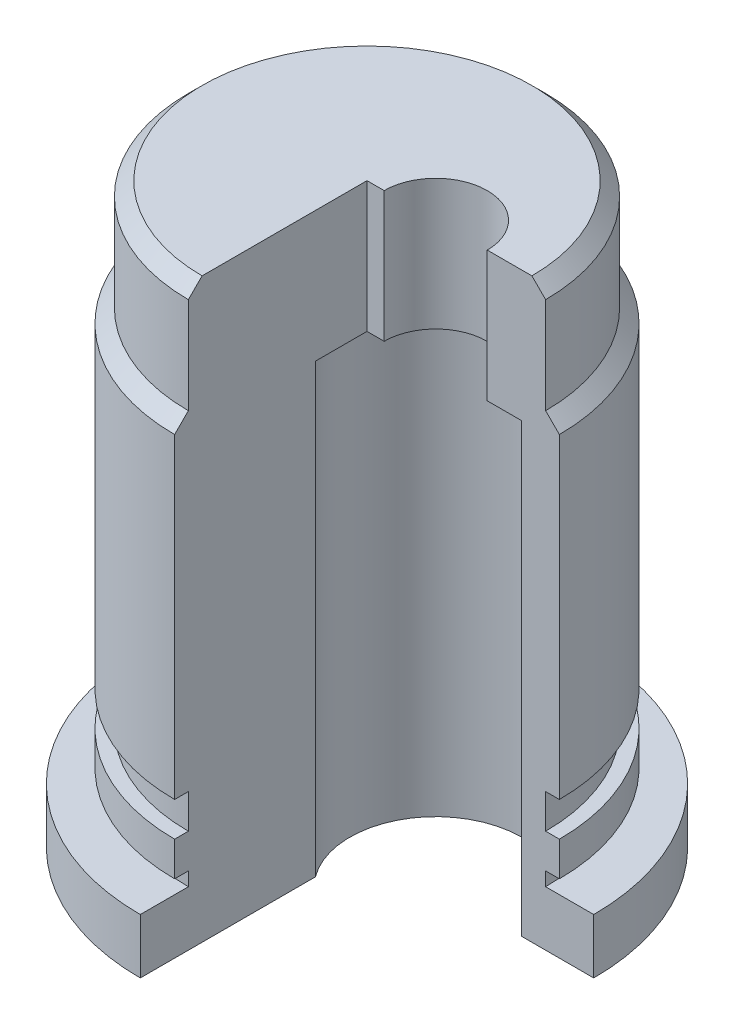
ISO-10303-21;
HEADER;
FILE_DESCRIPTION(('STEP AP214'),'2;1');
FILE_NAME('part.step','',(''),(''),'','','');
FILE_SCHEMA(('AUTOMOTIVE_DESIGN { 1 0 10303 214 1 1 1 1 }'));
ENDSEC;
DATA;
#1=APPLICATION_CONTEXT('core data for automotive mechanical design processes');
#2=APPLICATION_PROTOCOL_DEFINITION('international standard','automotive_design',2000,#1);
#3=PRODUCT_CONTEXT('',#1,'mechanical');
#4=PRODUCT('Part','Part','',(#3));
#5=PRODUCT_RELATED_PRODUCT_CATEGORY('part','',(#4));
#6=PRODUCT_DEFINITION_FORMATION('','',#4);
#7=PRODUCT_DEFINITION_CONTEXT('part definition',#1,'design');
#8=PRODUCT_DEFINITION('design','',#6,#7);
#9=PRODUCT_DEFINITION_SHAPE('','',#8);
#10=(LENGTH_UNIT() NAMED_UNIT(*) SI_UNIT(.MILLI.,.METRE.));
#11=(NAMED_UNIT(*) PLANE_ANGLE_UNIT() SI_UNIT($,.RADIAN.));
#12=(NAMED_UNIT(*) SI_UNIT($,.STERADIAN.) SOLID_ANGLE_UNIT());
#13=UNCERTAINTY_MEASURE_WITH_UNIT(LENGTH_MEASURE(1.E-05),#10,'distance_accuracy_value','');
#14=(GEOMETRIC_REPRESENTATION_CONTEXT(3) GLOBAL_UNCERTAINTY_ASSIGNED_CONTEXT((#13)) GLOBAL_UNIT_ASSIGNED_CONTEXT((#10,
#11,#12)) REPRESENTATION_CONTEXT('',''));
#15=CARTESIAN_POINT('',(0.,0.,0.));
#16=DIRECTION('',(0.,0.,1.));
#17=DIRECTION('',(1.,0.,0.));
#18=AXIS2_PLACEMENT_3D('',#15,#16,#17);
#19=CARTESIAN_POINT('',(0.,84.,0.));
#20=DIRECTION('',(0.,1.,0.));
#21=DIRECTION('',(-1.,0.,0.));
#22=AXIS2_PLACEMENT_3D('',#19,#20,#21);
#23=PLANE('',#22);
#24=DIRECTION('',(-1.,0.,0.));
#25=VECTOR('',#24,1.);
#26=CARTESIAN_POINT('',(0.,84.,0.));
#27=LINE('',#26,#25);
#28=CARTESIAN_POINT('',(24.,84.,0.));
#29=VERTEX_POINT('',#28);
#30=CARTESIAN_POINT('',(17.5,84.,0.));
#31=VERTEX_POINT('',#30);
#32=EDGE_CURVE('E53',#29,#31,#27,.T.);
#33=ORIENTED_EDGE('',*,*,#32,.F.);
#34=CARTESIAN_POINT('',(0.,84.,0.));
#35=DIRECTION('',(0.,-1.,0.));
#36=DIRECTION('',(1.,0.,0.));
#37=AXIS2_PLACEMENT_3D('',#34,#35,#36);
#38=CIRCLE('',#37,24.);
#39=CARTESIAN_POINT('',(0.,84.,24.));
#40=VERTEX_POINT('',#39);
#41=EDGE_CURVE('E172',#40,#29,#38,.T.);
#42=ORIENTED_EDGE('',*,*,#41,.F.);
#43=DIRECTION('',(0.,0.,1.));
#44=VECTOR('',#43,1.);
#45=CARTESIAN_POINT('',(0.,84.,0.));
#46=LINE('',#45,#44);
#47=CARTESIAN_POINT('',(0.,84.,0.));
#48=VERTEX_POINT('',#47);
#49=EDGE_CURVE('E157',#48,#40,#46,.T.);
#50=ORIENTED_EDGE('',*,*,#49,.F.);
#51=CARTESIAN_POINT('',(2.49999999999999,84.,0.));
#52=VERTEX_POINT('',#51);
#53=EDGE_CURVE('E163',#52,#48,#27,.T.);
#54=ORIENTED_EDGE('',*,*,#53,.F.);
#55=CARTESIAN_POINT('',(9.99999999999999,84.,0.));
#56=DIRECTION('',(0.,-1.,0.));
#57=DIRECTION('',(1.,0.,0.));
#58=AXIS2_PLACEMENT_3D('',#55,#56,#57);
#59=CIRCLE('',#58,7.5);
#60=EDGE_CURVE('E239',#52,#31,#59,.T.);
#61=ORIENTED_EDGE('',*,*,#60,.T.);
#62=EDGE_LOOP('',(#33,#42,#50,#54,#61));
#63=FACE_BOUND('',#62,.T.);
#64=ADVANCED_FACE('F31',(#63),#23,.T.);
#65=CARTESIAN_POINT('',(0.,82.,0.));
#66=DIRECTION('',(0.,-1.,0.));
#67=DIRECTION('',(1.,0.,0.));
#68=AXIS2_PLACEMENT_3D('',#65,#66,#67);
#69=CONICAL_SURFACE('',#68,26.0000000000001,0.78539816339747);
#70=DIRECTION('',(0.,0.707106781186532,-0.707106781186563));
#71=VECTOR('',#70,1.);
#72=CARTESIAN_POINT('',(0.,107.999999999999,0.));
#73=LINE('',#72,#71);
#74=CARTESIAN_POINT('',(0.,82.,26.0000000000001));
#75=VERTEX_POINT('',#74);
#76=EDGE_CURVE('E234',#40,#75,#73,.F.);
#77=ORIENTED_EDGE('',*,*,#76,.F.);
#78=ORIENTED_EDGE('',*,*,#41,.T.);
#79=DIRECTION('',(0.707106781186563,-0.707106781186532,0.));
#80=VECTOR('',#79,1.);
#81=CARTESIAN_POINT('',(0.,107.999999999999,0.));
#82=LINE('',#81,#80);
#83=CARTESIAN_POINT('',(26.0000000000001,82.,0.));
#84=VERTEX_POINT('',#83);
#85=EDGE_CURVE('E207',#84,#29,#82,.F.);
#86=ORIENTED_EDGE('',*,*,#85,.F.);
#87=CARTESIAN_POINT('',(0.,82.,0.));
#88=DIRECTION('',(0.,-1.,0.));
#89=DIRECTION('',(1.,0.,0.));
#90=AXIS2_PLACEMENT_3D('',#87,#88,#89);
#91=CIRCLE('',#90,26.0000000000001);
#92=EDGE_CURVE('E280',#75,#84,#91,.T.);
#93=ORIENTED_EDGE('',*,*,#92,.F.);
#94=EDGE_LOOP('',(#77,#78,#86,#93));
#95=FACE_BOUND('',#94,.T.);
#96=ADVANCED_FACE('F290',(#95),#69,.T.);
#97=CARTESIAN_POINT('',(0.,0.,0.));
#98=DIRECTION('',(0.,-1.,0.));
#99=DIRECTION('',(1.,0.,0.));
#100=AXIS2_PLACEMENT_3D('',#97,#98,#99);
#101=CYLINDRICAL_SURFACE('',#100,26.0000000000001);
#102=DIRECTION('',(0.,-1.,0.));
#103=VECTOR('',#102,1.);
#104=CARTESIAN_POINT('',(0.,0.,26.0000000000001));
#105=LINE('',#104,#103);
#106=CARTESIAN_POINT('',(0.,68.,26.0000000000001));
#107=VERTEX_POINT('',#106);
#108=EDGE_CURVE('E232',#75,#107,#105,.T.);
#109=ORIENTED_EDGE('',*,*,#108,.F.);
#110=ORIENTED_EDGE('',*,*,#92,.T.);
#111=DIRECTION('',(0.,-1.,0.));
#112=VECTOR('',#111,1.);
#113=CARTESIAN_POINT('',(26.0000000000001,0.,0.));
#114=LINE('',#113,#112);
#115=CARTESIAN_POINT('',(26.0000000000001,68.,0.));
#116=VERTEX_POINT('',#115);
#117=EDGE_CURVE('E205',#116,#84,#114,.F.);
#118=ORIENTED_EDGE('',*,*,#117,.F.);
#119=CARTESIAN_POINT('',(0.,68.,0.));
#120=DIRECTION('',(0.,-1.,0.));
#121=DIRECTION('',(1.,0.,0.));
#122=AXIS2_PLACEMENT_3D('',#119,#120,#121);
#123=CIRCLE('',#122,26.0000000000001);
#124=EDGE_CURVE('E277',#107,#116,#123,.T.);
#125=ORIENTED_EDGE('',*,*,#124,.F.);
#126=EDGE_LOOP('',(#109,#110,#118,#125));
#127=FACE_BOUND('',#126,.T.);
#128=ADVANCED_FACE('F296',(#127),#101,.T.);
#129=CARTESIAN_POINT('',(0.,66.0000000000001,0.));
#130=DIRECTION('',(0.,-1.,0.));
#131=DIRECTION('',(1.,0.,0.));
#132=AXIS2_PLACEMENT_3D('',#129,#130,#131);
#133=CONICAL_SURFACE('',#132,28.0000000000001,0.785398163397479);
#134=DIRECTION('',(0.,0.707106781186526,-0.707106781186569));
#135=VECTOR('',#134,1.);
#136=CARTESIAN_POINT('',(0.,93.9999999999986,0.));
#137=LINE('',#136,#135);
#138=CARTESIAN_POINT('',(0.,66.0000000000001,28.0000000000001));
#139=VERTEX_POINT('',#138);
#140=EDGE_CURVE('E230',#107,#139,#137,.F.);
#141=ORIENTED_EDGE('',*,*,#140,.F.);
#142=ORIENTED_EDGE('',*,*,#124,.T.);
#143=DIRECTION('',(0.707106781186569,-0.707106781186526,0.));
#144=VECTOR('',#143,1.);
#145=CARTESIAN_POINT('',(0.,93.9999999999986,0.));
#146=LINE('',#145,#144);
#147=CARTESIAN_POINT('',(28.0000000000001,66.0000000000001,0.));
#148=VERTEX_POINT('',#147);
#149=EDGE_CURVE('E203',#148,#116,#146,.F.);
#150=ORIENTED_EDGE('',*,*,#149,.F.);
#151=CARTESIAN_POINT('',(0.,66.0000000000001,0.));
#152=DIRECTION('',(0.,-1.,0.));
#153=DIRECTION('',(1.,0.,0.));
#154=AXIS2_PLACEMENT_3D('',#151,#152,#153);
#155=CIRCLE('',#154,28.0000000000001);
#156=EDGE_CURVE('E274',#139,#148,#155,.T.);
#157=ORIENTED_EDGE('',*,*,#156,.F.);
#158=EDGE_LOOP('',(#141,#142,#150,#157));
#159=FACE_BOUND('',#158,.T.);
#160=ADVANCED_FACE('F300',(#159),#133,.T.);
#161=CARTESIAN_POINT('',(0.,0.,0.));
#162=DIRECTION('',(0.,-1.,0.));
#163=DIRECTION('',(1.,0.,0.));
#164=AXIS2_PLACEMENT_3D('',#161,#162,#163);
#165=CYLINDRICAL_SURFACE('',#164,28.0000000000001);
#166=DIRECTION('',(0.,-1.,0.));
#167=VECTOR('',#166,1.);
#168=CARTESIAN_POINT('',(0.,0.,28.0000000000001));
#169=LINE('',#168,#167);
#170=CARTESIAN_POINT('',(0.,20.0000000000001,28.0000000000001));
#171=VERTEX_POINT('',#170);
#172=EDGE_CURVE('E228',#139,#171,#169,.T.);
#173=ORIENTED_EDGE('',*,*,#172,.F.);
#174=ORIENTED_EDGE('',*,*,#156,.T.);
#175=DIRECTION('',(0.,-1.,0.));
#176=VECTOR('',#175,1.);
#177=CARTESIAN_POINT('',(28.0000000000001,0.,0.));
#178=LINE('',#177,#176);
#179=CARTESIAN_POINT('',(28.0000000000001,20.0000000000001,0.));
#180=VERTEX_POINT('',#179);
#181=EDGE_CURVE('E201',#180,#148,#178,.F.);
#182=ORIENTED_EDGE('',*,*,#181,.F.);
#183=CARTESIAN_POINT('',(0.,20.0000000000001,0.));
#184=DIRECTION('',(0.,-1.,0.));
#185=DIRECTION('',(1.,0.,0.));
#186=AXIS2_PLACEMENT_3D('',#183,#184,#185);
#187=CIRCLE('',#186,28.0000000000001);
#188=EDGE_CURVE('E271',#171,#180,#187,.T.);
#189=ORIENTED_EDGE('',*,*,#188,.F.);
#190=EDGE_LOOP('',(#173,#174,#182,#189));
#191=FACE_BOUND('',#190,.T.);
#192=ADVANCED_FACE('F306',(#191),#165,.T.);
#193=CARTESIAN_POINT('',(28.0000000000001,20.0000000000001,0.));
#194=DIRECTION('',(0.,-1.,0.));
#195=DIRECTION('',(1.,0.,0.));
#196=AXIS2_PLACEMENT_3D('',#193,#194,#195);
#197=PLANE('',#196);
#198=DIRECTION('',(0.,0.,-1.));
#199=VECTOR('',#198,1.);
#200=CARTESIAN_POINT('',(0.,20.0000000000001,0.));
#201=LINE('',#200,#199);
#202=CARTESIAN_POINT('',(0.,20.,26.0000000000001));
#203=VERTEX_POINT('',#202);
#204=EDGE_CURVE('E226',#171,#203,#201,.T.);
#205=ORIENTED_EDGE('',*,*,#204,.F.);
#206=ORIENTED_EDGE('',*,*,#188,.T.);
#207=DIRECTION('',(1.,0.,0.));
#208=VECTOR('',#207,1.);
#209=CARTESIAN_POINT('',(28.0000000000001,20.0000000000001,0.));
#210=LINE('',#209,#208);
#211=CARTESIAN_POINT('',(26.0000000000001,20.,0.));
#212=VERTEX_POINT('',#211);
#213=EDGE_CURVE('E199',#212,#180,#210,.T.);
#214=ORIENTED_EDGE('',*,*,#213,.F.);
#215=CARTESIAN_POINT('',(0.,20.,0.));
#216=DIRECTION('',(0.,-1.,0.));
#217=DIRECTION('',(1.,0.,0.));
#218=AXIS2_PLACEMENT_3D('',#215,#216,#217);
#219=CIRCLE('',#218,26.0000000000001);
#220=EDGE_CURVE('E268',#203,#212,#219,.T.);
#221=ORIENTED_EDGE('',*,*,#220,.F.);
#222=EDGE_LOOP('',(#205,#206,#214,#221));
#223=FACE_BOUND('',#222,.T.);
#224=ADVANCED_FACE('F310',(#223),#197,.T.);
#225=CARTESIAN_POINT('',(0.,0.,0.));
#226=DIRECTION('',(0.,-1.,0.));
#227=DIRECTION('',(1.,0.,0.));
#228=AXIS2_PLACEMENT_3D('',#225,#226,#227);
#229=CYLINDRICAL_SURFACE('',#228,26.0000000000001);
#230=DIRECTION('',(0.,-1.,0.));
#231=VECTOR('',#230,1.);
#232=CARTESIAN_POINT('',(0.,0.,26.0000000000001));
#233=LINE('',#232,#231);
#234=CARTESIAN_POINT('',(0.,15.0000000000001,26.0000000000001));
#235=VERTEX_POINT('',#234);
#236=EDGE_CURVE('E224',#203,#235,#233,.T.);
#237=ORIENTED_EDGE('',*,*,#236,.F.);
#238=ORIENTED_EDGE('',*,*,#220,.T.);
#239=DIRECTION('',(0.,-1.,0.));
#240=VECTOR('',#239,1.);
#241=CARTESIAN_POINT('',(26.0000000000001,0.,0.));
#242=LINE('',#241,#240);
#243=CARTESIAN_POINT('',(26.0000000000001,15.0000000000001,0.));
#244=VERTEX_POINT('',#243);
#245=EDGE_CURVE('E197',#244,#212,#242,.F.);
#246=ORIENTED_EDGE('',*,*,#245,.F.);
#247=CARTESIAN_POINT('',(0.,15.0000000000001,0.));
#248=DIRECTION('',(0.,-1.,0.));
#249=DIRECTION('',(1.,0.,0.));
#250=AXIS2_PLACEMENT_3D('',#247,#248,#249);
#251=CIRCLE('',#250,26.0000000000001);
#252=EDGE_CURVE('E265',#235,#244,#251,.T.);
#253=ORIENTED_EDGE('',*,*,#252,.F.);
#254=EDGE_LOOP('',(#237,#238,#246,#253));
#255=FACE_BOUND('',#254,.T.);
#256=ADVANCED_FACE('F316',(#255),#229,.T.);
#257=CARTESIAN_POINT('',(26.0000000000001,15.0000000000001,0.));
#258=DIRECTION('',(0.,1.,0.));
#259=DIRECTION('',(-1.,0.,0.));
#260=AXIS2_PLACEMENT_3D('',#257,#258,#259);
#261=PLANE('',#260);
#262=DIRECTION('',(0.,0.,1.));
#263=VECTOR('',#262,1.);
#264=CARTESIAN_POINT('',(0.,15.0000000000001,0.));
#265=LINE('',#264,#263);
#266=CARTESIAN_POINT('',(0.,15.,28.0000000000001));
#267=VERTEX_POINT('',#266);
#268=EDGE_CURVE('E222',#235,#267,#265,.T.);
#269=ORIENTED_EDGE('',*,*,#268,.F.);
#270=ORIENTED_EDGE('',*,*,#252,.T.);
#271=DIRECTION('',(-1.,0.,0.));
#272=VECTOR('',#271,1.);
#273=CARTESIAN_POINT('',(26.0000000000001,15.0000000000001,0.));
#274=LINE('',#273,#272);
#275=CARTESIAN_POINT('',(28.0000000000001,15.,0.));
#276=VERTEX_POINT('',#275);
#277=EDGE_CURVE('E195',#276,#244,#274,.T.);
#278=ORIENTED_EDGE('',*,*,#277,.F.);
#279=CARTESIAN_POINT('',(0.,15.,0.));
#280=DIRECTION('',(0.,-1.,0.));
#281=DIRECTION('',(1.,0.,0.));
#282=AXIS2_PLACEMENT_3D('',#279,#280,#281);
#283=CIRCLE('',#282,28.0000000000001);
#284=EDGE_CURVE('E262',#267,#276,#283,.T.);
#285=ORIENTED_EDGE('',*,*,#284,.F.);
#286=EDGE_LOOP('',(#269,#270,#278,#285));
#287=FACE_BOUND('',#286,.T.);
#288=ADVANCED_FACE('F320',(#287),#261,.T.);
#289=CARTESIAN_POINT('',(0.,0.,0.));
#290=DIRECTION('',(0.,-1.,0.));
#291=DIRECTION('',(1.,0.,0.));
#292=AXIS2_PLACEMENT_3D('',#289,#290,#291);
#293=CYLINDRICAL_SURFACE('',#292,28.0000000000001);
#294=DIRECTION('',(0.,-1.,0.));
#295=VECTOR('',#294,1.);
#296=CARTESIAN_POINT('',(0.,0.,28.0000000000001));
#297=LINE('',#296,#295);
#298=CARTESIAN_POINT('',(0.,10.,28.0000000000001));
#299=VERTEX_POINT('',#298);
#300=EDGE_CURVE('E220',#267,#299,#297,.T.);
#301=ORIENTED_EDGE('',*,*,#300,.F.);
#302=ORIENTED_EDGE('',*,*,#284,.T.);
#303=DIRECTION('',(0.,-1.,0.));
#304=VECTOR('',#303,1.);
#305=CARTESIAN_POINT('',(28.0000000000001,0.,0.));
#306=LINE('',#305,#304);
#307=CARTESIAN_POINT('',(28.0000000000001,10.,0.));
#308=VERTEX_POINT('',#307);
#309=EDGE_CURVE('E193',#308,#276,#306,.F.);
#310=ORIENTED_EDGE('',*,*,#309,.F.);
#311=CARTESIAN_POINT('',(0.,10.,0.));
#312=DIRECTION('',(0.,-1.,0.));
#313=DIRECTION('',(1.,0.,0.));
#314=AXIS2_PLACEMENT_3D('',#311,#312,#313);
#315=CIRCLE('',#314,28.0000000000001);
#316=EDGE_CURVE('E259',#299,#308,#315,.T.);
#317=ORIENTED_EDGE('',*,*,#316,.F.);
#318=EDGE_LOOP('',(#301,#302,#310,#317));
#319=FACE_BOUND('',#318,.T.);
#320=ADVANCED_FACE('F326',(#319),#293,.T.);
#321=CARTESIAN_POINT('',(28.0000000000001,10.,0.));
#322=DIRECTION('',(0.,-1.,0.));
#323=DIRECTION('',(1.,0.,0.));
#324=AXIS2_PLACEMENT_3D('',#321,#322,#323);
#325=PLANE('',#324);
#326=DIRECTION('',(0.,0.,-1.));
#327=VECTOR('',#326,1.);
#328=CARTESIAN_POINT('',(0.,10.,0.));
#329=LINE('',#328,#327);
#330=CARTESIAN_POINT('',(0.,10.,26.0000000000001));
#331=VERTEX_POINT('',#330);
#332=EDGE_CURVE('E218',#299,#331,#329,.T.);
#333=ORIENTED_EDGE('',*,*,#332,.F.);
#334=ORIENTED_EDGE('',*,*,#316,.T.);
#335=DIRECTION('',(1.,0.,0.));
#336=VECTOR('',#335,1.);
#337=CARTESIAN_POINT('',(28.0000000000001,10.,0.));
#338=LINE('',#337,#336);
#339=CARTESIAN_POINT('',(26.0000000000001,10.,0.));
#340=VERTEX_POINT('',#339);
#341=EDGE_CURVE('E191',#340,#308,#338,.T.);
#342=ORIENTED_EDGE('',*,*,#341,.F.);
#343=CARTESIAN_POINT('',(0.,10.,0.));
#344=DIRECTION('',(0.,-1.,0.));
#345=DIRECTION('',(1.,0.,0.));
#346=AXIS2_PLACEMENT_3D('',#343,#344,#345);
#347=CIRCLE('',#346,26.0000000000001);
#348=EDGE_CURVE('E256',#331,#340,#347,.T.);
#349=ORIENTED_EDGE('',*,*,#348,.F.);
#350=EDGE_LOOP('',(#333,#334,#342,#349));
#351=FACE_BOUND('',#350,.T.);
#352=ADVANCED_FACE('F330',(#351),#325,.T.);
#353=CARTESIAN_POINT('',(0.,0.,0.));
#354=DIRECTION('',(0.,-1.,0.));
#355=DIRECTION('',(1.,0.,0.));
#356=AXIS2_PLACEMENT_3D('',#353,#354,#355);
#357=CYLINDRICAL_SURFACE('',#356,26.0000000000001);
#358=DIRECTION('',(0.,-1.,0.));
#359=VECTOR('',#358,1.);
#360=CARTESIAN_POINT('',(0.,0.,26.0000000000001));
#361=LINE('',#360,#359);
#362=CARTESIAN_POINT('',(0.,8.,26.0000000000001));
#363=VERTEX_POINT('',#362);
#364=EDGE_CURVE('E216',#331,#363,#361,.T.);
#365=ORIENTED_EDGE('',*,*,#364,.F.);
#366=ORIENTED_EDGE('',*,*,#348,.T.);
#367=DIRECTION('',(0.,-1.,0.));
#368=VECTOR('',#367,1.);
#369=CARTESIAN_POINT('',(26.0000000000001,0.,0.));
#370=LINE('',#369,#368);
#371=CARTESIAN_POINT('',(26.0000000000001,8.,0.));
#372=VERTEX_POINT('',#371);
#373=EDGE_CURVE('E189',#372,#340,#370,.F.);
#374=ORIENTED_EDGE('',*,*,#373,.F.);
#375=CARTESIAN_POINT('',(0.,8.,0.));
#376=DIRECTION('',(0.,-1.,0.));
#377=DIRECTION('',(1.,0.,0.));
#378=AXIS2_PLACEMENT_3D('',#375,#376,#377);
#379=CIRCLE('',#378,26.0000000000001);
#380=EDGE_CURVE('E253',#363,#372,#379,.T.);
#381=ORIENTED_EDGE('',*,*,#380,.F.);
#382=EDGE_LOOP('',(#365,#366,#374,#381));
#383=FACE_BOUND('',#382,.T.);
#384=ADVANCED_FACE('F336',(#383),#357,.T.);
#385=CARTESIAN_POINT('',(26.0000000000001,8.,0.));
#386=DIRECTION('',(0.,1.,0.));
#387=DIRECTION('',(-1.,0.,0.));
#388=AXIS2_PLACEMENT_3D('',#385,#386,#387);
#389=PLANE('',#388);
#390=DIRECTION('',(0.,0.,1.));
#391=VECTOR('',#390,1.);
#392=CARTESIAN_POINT('',(0.,8.,0.));
#393=LINE('',#392,#391);
#394=CARTESIAN_POINT('',(0.,8.,33.));
#395=VERTEX_POINT('',#394);
#396=EDGE_CURVE('E214',#363,#395,#393,.T.);
#397=ORIENTED_EDGE('',*,*,#396,.F.);
#398=ORIENTED_EDGE('',*,*,#380,.T.);
#399=DIRECTION('',(-1.,0.,0.));
#400=VECTOR('',#399,1.);
#401=CARTESIAN_POINT('',(26.0000000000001,8.,0.));
#402=LINE('',#401,#400);
#403=CARTESIAN_POINT('',(33.,8.,0.));
#404=VERTEX_POINT('',#403);
#405=EDGE_CURVE('E187',#404,#372,#402,.T.);
#406=ORIENTED_EDGE('',*,*,#405,.F.);
#407=CARTESIAN_POINT('',(0.,8.,0.));
#408=DIRECTION('',(0.,-1.,0.));
#409=DIRECTION('',(1.,0.,0.));
#410=AXIS2_PLACEMENT_3D('',#407,#408,#409);
#411=CIRCLE('',#410,33.);
#412=EDGE_CURVE('E250',#395,#404,#411,.T.);
#413=ORIENTED_EDGE('',*,*,#412,.F.);
#414=EDGE_LOOP('',(#397,#398,#406,#413));
#415=FACE_BOUND('',#414,.T.);
#416=ADVANCED_FACE('F340',(#415),#389,.T.);
#417=CARTESIAN_POINT('',(0.,0.,0.));
#418=DIRECTION('',(0.,-1.,0.));
#419=DIRECTION('',(1.,0.,0.));
#420=AXIS2_PLACEMENT_3D('',#417,#418,#419);
#421=CYLINDRICAL_SURFACE('',#420,33.);
#422=DIRECTION('',(0.,-1.,0.));
#423=VECTOR('',#422,1.);
#424=CARTESIAN_POINT('',(0.,0.,33.));
#425=LINE('',#424,#423);
#426=CARTESIAN_POINT('',(0.,0.,33.));
#427=VERTEX_POINT('',#426);
#428=EDGE_CURVE('E212',#395,#427,#425,.T.);
#429=ORIENTED_EDGE('',*,*,#428,.F.);
#430=ORIENTED_EDGE('',*,*,#412,.T.);
#431=DIRECTION('',(0.,-1.,0.));
#432=VECTOR('',#431,1.);
#433=CARTESIAN_POINT('',(33.,0.,0.));
#434=LINE('',#433,#432);
#435=CARTESIAN_POINT('',(33.,0.,0.));
#436=VERTEX_POINT('',#435);
#437=EDGE_CURVE('E185',#436,#404,#434,.F.);
#438=ORIENTED_EDGE('',*,*,#437,.F.);
#439=CARTESIAN_POINT('',(0.,0.,0.));
#440=DIRECTION('',(0.,-1.,0.));
#441=DIRECTION('',(1.,0.,0.));
#442=AXIS2_PLACEMENT_3D('',#439,#440,#441);
#443=CIRCLE('',#442,33.);
#444=EDGE_CURVE('E247',#427,#436,#443,.T.);
#445=ORIENTED_EDGE('',*,*,#444,.F.);
#446=EDGE_LOOP('',(#429,#430,#438,#445));
#447=FACE_BOUND('',#446,.T.);
#448=ADVANCED_FACE('F345',(#447),#421,.T.);
#449=CARTESIAN_POINT('',(33.,0.,0.));
#450=DIRECTION('',(0.,-1.,0.));
#451=DIRECTION('',(1.,0.,0.));
#452=AXIS2_PLACEMENT_3D('',#449,#450,#451);
#453=PLANE('',#452);
#454=DIRECTION('',(0.,0.,1.));
#455=VECTOR('',#454,1.);
#456=CARTESIAN_POINT('',(0.,0.,0.));
#457=LINE('',#456,#455);
#458=CARTESIAN_POINT('',(0.,0.,7.49999999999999));
#459=VERTEX_POINT('',#458);
#460=EDGE_CURVE('E175',#459,#427,#457,.T.);
#461=ORIENTED_EDGE('',*,*,#460,.T.);
#462=ORIENTED_EDGE('',*,*,#444,.T.);
#463=DIRECTION('',(-1.,0.,0.));
#464=VECTOR('',#463,1.);
#465=CARTESIAN_POINT('',(0.,0.,0.));
#466=LINE('',#465,#464);
#467=CARTESIAN_POINT('',(22.5,0.,0.));
#468=VERTEX_POINT('',#467);
#469=EDGE_CURVE('E160',#436,#468,#466,.T.);
#470=ORIENTED_EDGE('',*,*,#469,.T.);
#471=CARTESIAN_POINT('',(10.,0.,0.));
#472=DIRECTION('',(0.,-1.,0.));
#473=DIRECTION('',(1.,0.,0.));
#474=AXIS2_PLACEMENT_3D('',#471,#472,#473);
#475=CIRCLE('',#474,12.5);
#476=EDGE_CURVE('E241',#459,#468,#475,.T.);
#477=ORIENTED_EDGE('',*,*,#476,.F.);
#478=EDGE_LOOP('',(#461,#462,#470,#477));
#479=FACE_BOUND('',#478,.T.);
#480=ADVANCED_FACE('F348',(#479),#453,.T.);
#481=CARTESIAN_POINT('',(9.99999999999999,65.,0.));
#482=DIRECTION('',(0.,-1.,0.));
#483=DIRECTION('',(1.,0.,0.));
#484=AXIS2_PLACEMENT_3D('',#481,#482,#483);
#485=CYLINDRICAL_SURFACE('',#484,12.5);
#486=CARTESIAN_POINT('',(9.99999999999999,65.,0.));
#487=DIRECTION('',(0.,-1.,0.));
#488=DIRECTION('',(1.,0.,0.));
#489=AXIS2_PLACEMENT_3D('',#486,#487,#488);
#490=CIRCLE('',#489,12.5);
#491=CARTESIAN_POINT('',(0.,65.,7.49999999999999));
#492=VERTEX_POINT('',#491);
#493=CARTESIAN_POINT('',(22.5,65.,0.));
#494=VERTEX_POINT('',#493);
#495=EDGE_CURVE('E244',#492,#494,#490,.T.);
#496=ORIENTED_EDGE('',*,*,#495,.F.);
#497=DIRECTION('',(0.,-1.,0.));
#498=VECTOR('',#497,1.);
#499=CARTESIAN_POINT('',(0.,65.,7.49999999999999));
#500=LINE('',#499,#498);
#501=EDGE_CURVE('E209',#492,#459,#500,.T.);
#502=ORIENTED_EDGE('',*,*,#501,.T.);
#503=ORIENTED_EDGE('',*,*,#476,.T.);
#504=DIRECTION('',(0.,-1.,0.));
#505=VECTOR('',#504,1.);
#506=CARTESIAN_POINT('',(22.5,65.,0.));
#507=LINE('',#506,#505);
#508=EDGE_CURVE('E182',#468,#494,#507,.F.);
#509=ORIENTED_EDGE('',*,*,#508,.T.);
#510=EDGE_LOOP('',(#496,#502,#503,#509));
#511=FACE_BOUND('',#510,.T.);
#512=ADVANCED_FACE('F352',(#511),#485,.F.);
#513=CARTESIAN_POINT('',(9.99999999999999,65.,0.));
#514=DIRECTION('',(0.,-1.,0.));
#515=DIRECTION('',(1.,0.,0.));
#516=AXIS2_PLACEMENT_3D('',#513,#514,#515);
#517=PLANE('',#516);
#518=DIRECTION('',(0.,0.,-1.));
#519=VECTOR('',#518,1.);
#520=CARTESIAN_POINT('',(0.,65.,0.));
#521=LINE('',#520,#519);
#522=CARTESIAN_POINT('',(0.,65.,0.));
#523=VERTEX_POINT('',#522);
#524=EDGE_CURVE('E11',#492,#523,#521,.T.);
#525=ORIENTED_EDGE('',*,*,#524,.F.);
#526=ORIENTED_EDGE('',*,*,#495,.T.);
#527=DIRECTION('',(1.,0.,0.));
#528=VECTOR('',#527,1.);
#529=CARTESIAN_POINT('',(9.99999999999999,65.,0.));
#530=LINE('',#529,#528);
#531=CARTESIAN_POINT('',(17.5,65.,0.));
#532=VERTEX_POINT('',#531);
#533=EDGE_CURVE('E181',#532,#494,#530,.T.);
#534=ORIENTED_EDGE('',*,*,#533,.F.);
#535=CARTESIAN_POINT('',(9.99999999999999,65.,0.));
#536=DIRECTION('',(0.,-1.,0.));
#537=DIRECTION('',(1.,0.,0.));
#538=AXIS2_PLACEMENT_3D('',#535,#536,#537);
#539=CIRCLE('',#538,7.5);
#540=CARTESIAN_POINT('',(2.5,65.,0.));
#541=VERTEX_POINT('',#540);
#542=EDGE_CURVE('E236',#541,#532,#539,.T.);
#543=ORIENTED_EDGE('',*,*,#542,.F.);
#544=EDGE_CURVE('E45',#523,#541,#530,.T.);
#545=ORIENTED_EDGE('',*,*,#544,.F.);
#546=EDGE_LOOP('',(#525,#526,#534,#543,#545));
#547=FACE_BOUND('',#546,.T.);
#548=ADVANCED_FACE('F354',(#547),#517,.T.);
#549=CARTESIAN_POINT('',(9.99999999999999,84.,0.));
#550=DIRECTION('',(0.,-1.,0.));
#551=DIRECTION('',(1.,0.,0.));
#552=AXIS2_PLACEMENT_3D('',#549,#550,#551);
#553=CYLINDRICAL_SURFACE('',#552,7.5);
#554=ORIENTED_EDGE('',*,*,#542,.T.);
#555=DIRECTION('',(0.,-1.,0.));
#556=VECTOR('',#555,1.);
#557=CARTESIAN_POINT('',(17.5,84.,0.));
#558=LINE('',#557,#556);
#559=EDGE_CURVE('E38',#532,#31,#558,.F.);
#560=ORIENTED_EDGE('',*,*,#559,.T.);
#561=ORIENTED_EDGE('',*,*,#60,.F.);
#562=DIRECTION('',(0.,-1.,0.));
#563=VECTOR('',#562,1.);
#564=CARTESIAN_POINT('',(2.49999999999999,84.,0.));
#565=LINE('',#564,#563);
#566=EDGE_CURVE('E165',#52,#541,#565,.T.);
#567=ORIENTED_EDGE('',*,*,#566,.T.);
#568=EDGE_LOOP('',(#554,#560,#561,#567));
#569=FACE_BOUND('',#568,.T.);
#570=ADVANCED_FACE('F285',(#569),#553,.F.);
#571=CARTESIAN_POINT('',(0.,0.,0.));
#572=DIRECTION('',(0.,0.,-1.));
#573=DIRECTION('',(-1.,0.,0.));
#574=AXIS2_PLACEMENT_3D('',#571,#572,#573);
#575=PLANE('',#574);
#576=ORIENTED_EDGE('',*,*,#544,.T.);
#577=ORIENTED_EDGE('',*,*,#566,.F.);
#578=ORIENTED_EDGE('',*,*,#53,.T.);
#579=DIRECTION('',(0.,1.,0.));
#580=VECTOR('',#579,1.);
#581=CARTESIAN_POINT('',(0.,0.,0.));
#582=LINE('',#581,#580);
#583=EDGE_CURVE('E153',#523,#48,#582,.T.);
#584=ORIENTED_EDGE('',*,*,#583,.F.);
#585=EDGE_LOOP('',(#576,#577,#578,#584));
#586=FACE_BOUND('',#585,.T.);
#587=ADVANCED_FACE('F164',(#586),#575,.F.);
#588=CARTESIAN_POINT('',(0.,0.,0.));
#589=DIRECTION('',(-1.,0.,0.));
#590=DIRECTION('',(0.,-1.,0.));
#591=AXIS2_PLACEMENT_3D('',#588,#589,#590);
#592=PLANE('',#591);
#593=ORIENTED_EDGE('',*,*,#76,.T.);
#594=ORIENTED_EDGE('',*,*,#108,.T.);
#595=ORIENTED_EDGE('',*,*,#140,.T.);
#596=ORIENTED_EDGE('',*,*,#172,.T.);
#597=ORIENTED_EDGE('',*,*,#204,.T.);
#598=ORIENTED_EDGE('',*,*,#236,.T.);
#599=ORIENTED_EDGE('',*,*,#268,.T.);
#600=ORIENTED_EDGE('',*,*,#300,.T.);
#601=ORIENTED_EDGE('',*,*,#332,.T.);
#602=ORIENTED_EDGE('',*,*,#364,.T.);
#603=ORIENTED_EDGE('',*,*,#396,.T.);
#604=ORIENTED_EDGE('',*,*,#428,.T.);
#605=ORIENTED_EDGE('',*,*,#460,.F.);
#606=ORIENTED_EDGE('',*,*,#501,.F.);
#607=ORIENTED_EDGE('',*,*,#524,.T.);
#608=ORIENTED_EDGE('',*,*,#583,.T.);
#609=ORIENTED_EDGE('',*,*,#49,.T.);
#610=EDGE_LOOP('',(#593,#594,#595,#596,#597,#598,#599,#600,#601,#602,#603,#604,#605,#606,#607,
#608,#609));
#611=FACE_BOUND('',#610,.T.);
#612=ADVANCED_FACE('F155',(#611),#592,.F.);
#613=ORIENTED_EDGE('',*,*,#85,.T.);
#614=ORIENTED_EDGE('',*,*,#32,.T.);
#615=ORIENTED_EDGE('',*,*,#559,.F.);
#616=ORIENTED_EDGE('',*,*,#533,.T.);
#617=ORIENTED_EDGE('',*,*,#508,.F.);
#618=ORIENTED_EDGE('',*,*,#469,.F.);
#619=ORIENTED_EDGE('',*,*,#437,.T.);
#620=ORIENTED_EDGE('',*,*,#405,.T.);
#621=ORIENTED_EDGE('',*,*,#373,.T.);
#622=ORIENTED_EDGE('',*,*,#341,.T.);
#623=ORIENTED_EDGE('',*,*,#309,.T.);
#624=ORIENTED_EDGE('',*,*,#277,.T.);
#625=ORIENTED_EDGE('',*,*,#245,.T.);
#626=ORIENTED_EDGE('',*,*,#213,.T.);
#627=ORIENTED_EDGE('',*,*,#181,.T.);
#628=ORIENTED_EDGE('',*,*,#149,.T.);
#629=ORIENTED_EDGE('',*,*,#117,.T.);
#630=EDGE_LOOP('',(#613,#614,#615,#616,#617,#618,#619,#620,#621,#622,#623,#624,#625,#626,#627,
#628,#629));
#631=FACE_BOUND('',#630,.T.);
#632=ADVANCED_FACE('F355',(#631),#575,.F.);
#633=CLOSED_SHELL('',(#64,#96,#128,#160,#192,#224,#256,#288,#320,#352,#384,#416,#448,#480,#512,
#548,#570,#587,#612,#632));
#634=MANIFOLD_SOLID_BREP('B2',#633);
#635=ADVANCED_BREP_SHAPE_REPRESENTATION('',(#18,#634),#14);
#636=SHAPE_DEFINITION_REPRESENTATION(#9,#635);
ENDSEC;
END-ISO-10303-21;
